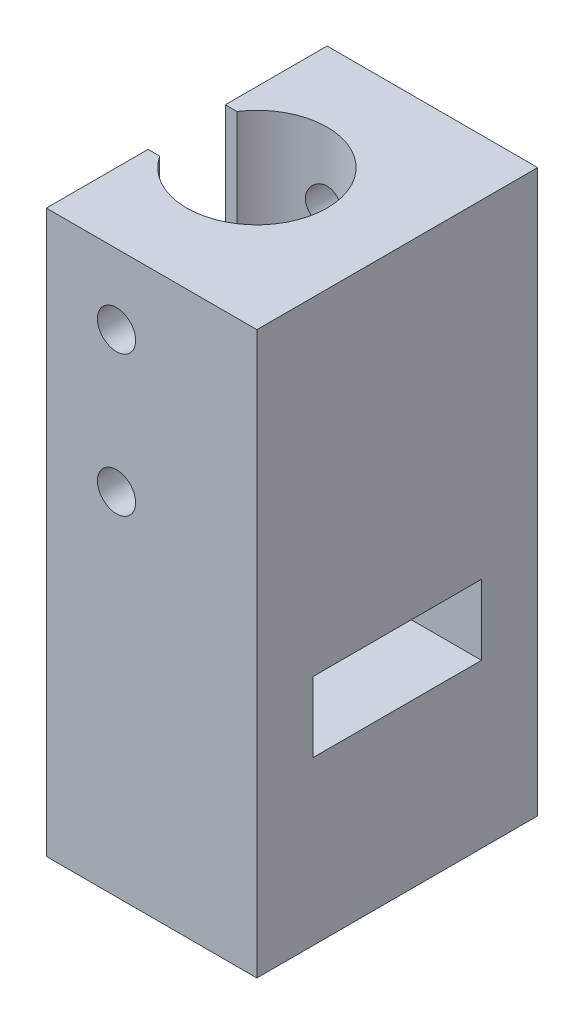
from build123d import *

# Parameters (mm, degrees)
SKETCH1_W                  = 25.4
SKETCH1_H                  = 25.4
BOSS_EXTRUDE1_DEPTH        = 50.8
SKETCH2_R                  = 4.445
CUT_EXTRUDE1_DEPTH         = 44.45
SKETCH3_R                  = 6.35
CUT_EXTRUDE2_DEPTH         = 25.4
SKETCH5_W                  = 6.985
SKETCH5_H                  = 35.306
CUT_EXTRUDE3_DEPTH         = 12.7
SKETCH6_W                  = 15.24
SKETCH6_H                  = 6.35
CUT_EXTRUDE4_DEPTH         = 25.4
F_8_32_TAPPED_HOLE2_REACH  = 71.07
F_8_32_TAPPED_HOLE2_BORE_R = 1.7272
F_8_32_TAPPED_HOLE3_D      = 3.4544
SKETCH13_W                 = 8.89
SKETCH13_H                 = 1.6002
CUT_EXTRUDE5_DEPTH         = 12.7
SKETCH17_W                 = 6.35
SKETCH17_H                 = 25.4
CUT_EXTRUDE18_DEPTH        = 50.8


with BuildPart() as part:
    # Sketch1 → Boss-Extrude1 (new body)
    with BuildSketch(Plane(origin=(0, 0, 0), x_dir=(1, 0, 0), z_dir=(0, 1, 0))):
        with Locations((-26.605360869, 9.484620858)):
            Rectangle(SKETCH1_W, SKETCH1_H)
    extrude(amount=BOSS_EXTRUDE1_DEPTH)

    # Sketch2 → Cut-Extrude1 (cut)
    with BuildSketch(Plane(origin=(0, 50.8, 0), x_dir=(1, 0, 0), z_dir=(0, 1, 0))):
        with Locations(Location((-26.605360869, 9.484620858, 0), (0, 0, 270))):
            Circle(SKETCH2_R)
    extrude(amount=-CUT_EXTRUDE1_DEPTH, mode=Mode.SUBTRACT)

    # Sketch3 → Cut-Extrude2 (cut)
    with BuildSketch(Plane(origin=(0, 50.8, 0), x_dir=(1, 0, 0), z_dir=(0, 1, 0))):
        with Locations(Location((-26.605360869, 9.484620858, 0), (0, 0, 270))):
            Circle(SKETCH3_R)
    extrude(amount=-CUT_EXTRUDE2_DEPTH, mode=Mode.SUBTRACT)

    # Sketch5 → Cut-Extrude3 (cut)
    with BuildSketch(Plane.ZY.offset(39.305360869)):
        with Locations((-9.484620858, 33.147)):
            Rectangle(SKETCH5_W, SKETCH5_H)
    extrude(amount=-CUT_EXTRUDE3_DEPTH, mode=Mode.SUBTRACT)

    # Sketch6 → Cut-Extrude4 (cut)
    with BuildSketch(Plane.ZY.offset(39.305360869)):
        with Locations((-9.484620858, 17.907)):
            Rectangle(SKETCH6_W, SKETCH6_H)
    extrude(amount=-CUT_EXTRUDE4_DEPTH, mode=Mode.SUBTRACT)

    # 8-32 Tapped Hole2 bore → 8-32 Tapped Hole2 (cut, up to next)
    with BuildSketch(Plane(origin=(0, 0, -22.184620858), x_dir=(-1, 0, 0), z_dir=(0, 0, -1)), mode=Mode.PRIVATE) as f_8_32_tapped_hole2_sk1:
        with Locations((26.605360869, 44.45)):
            Circle(F_8_32_TAPPED_HOLE2_BORE_R)
    f_8_32_tapped_hole2_tool1 = extrude(f_8_32_tapped_hole2_sk1.sketch, amount=-F_8_32_TAPPED_HOLE2_REACH, mode=Mode.PRIVATE) & part.part
    # 8-32 Tapped Hole2 bore → 8-32 Tapped Hole2 (cut, up to next)
    with BuildSketch(Plane(origin=(0, 0, -22.184620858), x_dir=(-1, 0, 0), z_dir=(0, 0, -1)), mode=Mode.PRIVATE) as f_8_32_tapped_hole2_sk2:
        with Locations((26.605360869, 31.75)):
            Circle(F_8_32_TAPPED_HOLE2_BORE_R)
    f_8_32_tapped_hole2_tool2 = extrude(f_8_32_tapped_hole2_sk2.sketch, amount=-F_8_32_TAPPED_HOLE2_REACH, mode=Mode.PRIVATE) & part.part
    add(f_8_32_tapped_hole2_tool1.solids().sort_by_distance((-26.605361, 44.45, -22.184621))[0], mode=Mode.SUBTRACT)
    add(f_8_32_tapped_hole2_tool2.solids().sort_by_distance((-26.605361, 31.75, -22.184621))[0], mode=Mode.SUBTRACT)

    # 8-32 Tapped Hole3 (through all)
    with Locations(Plane.XY.offset(3.215379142)):
        with Locations((-26.605360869, 44.45), (-26.605360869, 31.75)):
            Hole(F_8_32_TAPPED_HOLE3_D / 2)

    # Sketch13 → Cut-Extrude5 (cut)
    with BuildSketch(Plane.ZY.offset(39.305360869)):
        with Locations((-9.484620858, 7.1501)):
            Rectangle(SKETCH13_W, SKETCH13_H)
    extrude(amount=-CUT_EXTRUDE5_DEPTH, mode=Mode.SUBTRACT)

    # Sketch17 → Cut-Extrude18 (cut)
    with BuildSketch(Plane.XZ):
        with Locations((-36.130360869, -9.484620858)):
            Rectangle(SKETCH17_W, SKETCH17_H)
    extrude(amount=-CUT_EXTRUDE18_DEPTH, mode=Mode.SUBTRACT)


solid = part.part
